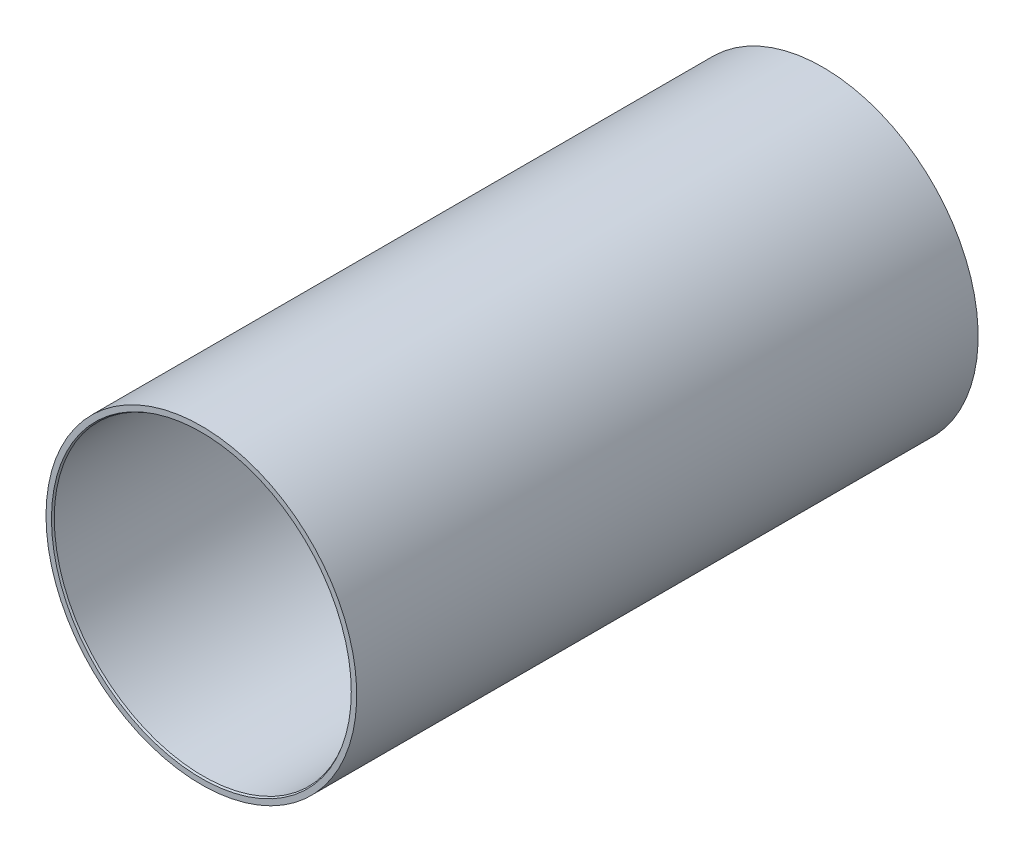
from build123d import *
from OCP.BRepFilletAPI import BRepFilletAPI_MakeChamfer

# Parameters (mm, degrees)
SKETCH1_R           = 152.4
SKETCH1_R_2         = 146.05
BOSS_EXTRUDE1_DEPTH = 609.6
CHAMFER1_SIZE       = 1.016
CHAMFER1_SIZE2      = 1.75976362


with BuildPart() as part:
    # Sketch1 → Boss-Extrude1 (new body)
    with BuildSketch(Plane.XY):
        with Locations(Location((0, 0, 0), (0, 0, 180))):
            Circle(SKETCH1_R)
        with Locations(Location((0, 0, 0), (0, 0, 180))):
            Circle(SKETCH1_R_2, mode=Mode.SUBTRACT)
    extrude(amount=BOSS_EXTRUDE1_DEPTH)

    # Chamfer1: one chamfer whose edges measure the first distance from different faces: ONE call of the kernel's chamfer builder (chamfer() names one face for all edges)
    chamfer1_edges_1 = [part.edges().sort_by_distance(p)[0] for p in [
        (146.05, 0, 0),
    ]]
    chamfer1_side_1 = [part.faces().sort_by_distance(p)[0] for p in [
        (148.089477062, 0, 0),
    ]]
    chamfer1_edges_2 = [part.edges().sort_by_distance(p)[0] for p in [
        (146.05, 0, 609.6),
    ]]
    chamfer1_side_2 = [part.faces().sort_by_distance(p)[0] for p in [
        (148.089477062, 0, 609.6),
    ]]
    chamfer1 = BRepFilletAPI_MakeChamfer(part.part.solid().wrapped)
    for e in chamfer1_edges_1:
        chamfer1.Add(CHAMFER1_SIZE, CHAMFER1_SIZE2, e.wrapped, chamfer1_side_1[0].wrapped)  # the first distance lies on this face
    for e in chamfer1_edges_2:
        chamfer1.Add(CHAMFER1_SIZE, CHAMFER1_SIZE2, e.wrapped, chamfer1_side_2[0].wrapped)  # the first distance lies on this face
    add(Compound.cast(chamfer1.Shape()), mode=Mode.REPLACE)


solid = part.part
